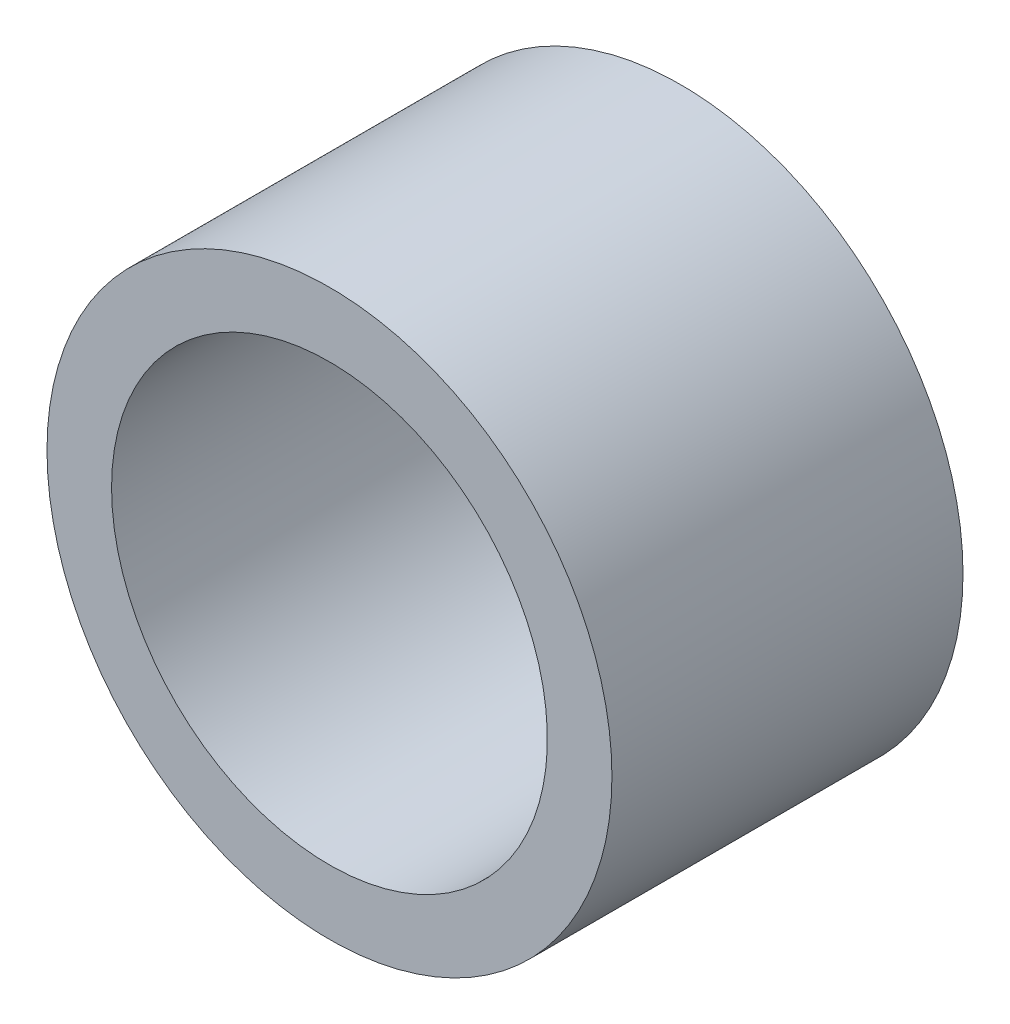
ISO-10303-21;
HEADER;
FILE_DESCRIPTION(('STEP AP214'),'2;1');
FILE_NAME('part.step','',(''),(''),'','','');
FILE_SCHEMA(('AUTOMOTIVE_DESIGN { 1 0 10303 214 1 1 1 1 }'));
ENDSEC;
DATA;
#1=APPLICATION_CONTEXT('core data for automotive mechanical design processes');
#2=APPLICATION_PROTOCOL_DEFINITION('international standard','automotive_design',2000,#1);
#3=PRODUCT_CONTEXT('',#1,'mechanical');
#4=PRODUCT('Part','Part','',(#3));
#5=PRODUCT_RELATED_PRODUCT_CATEGORY('part','',(#4));
#6=PRODUCT_DEFINITION_FORMATION('','',#4);
#7=PRODUCT_DEFINITION_CONTEXT('part definition',#1,'design');
#8=PRODUCT_DEFINITION('design','',#6,#7);
#9=PRODUCT_DEFINITION_SHAPE('','',#8);
#10=(LENGTH_UNIT() NAMED_UNIT(*) SI_UNIT(.MILLI.,.METRE.));
#11=(NAMED_UNIT(*) PLANE_ANGLE_UNIT() SI_UNIT($,.RADIAN.));
#12=(NAMED_UNIT(*) SI_UNIT($,.STERADIAN.) SOLID_ANGLE_UNIT());
#13=UNCERTAINTY_MEASURE_WITH_UNIT(LENGTH_MEASURE(1.E-05),#10,'distance_accuracy_value','');
#14=(GEOMETRIC_REPRESENTATION_CONTEXT(3) GLOBAL_UNCERTAINTY_ASSIGNED_CONTEXT((#13)) GLOBAL_UNIT_ASSIGNED_CONTEXT((#10,
#11,#12)) REPRESENTATION_CONTEXT('',''));
#15=CARTESIAN_POINT('',(0.,0.,0.));
#16=DIRECTION('',(0.,0.,1.));
#17=DIRECTION('',(1.,0.,0.));
#18=AXIS2_PLACEMENT_3D('',#15,#16,#17);
#19=CARTESIAN_POINT('',(2.22044604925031E-13,-1.04246038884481E-13,21.7499999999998));
#20=DIRECTION('',(0.,0.,0.999999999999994));
#21=DIRECTION('',(1.,0.,0.));
#22=AXIS2_PLACEMENT_3D('',#19,#20,#21);
#23=PLANE('',#22);
#24=CARTESIAN_POINT('',(2.22044604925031E-13,-1.04246038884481E-13,21.7499999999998));
#25=DIRECTION('',(0.,0.,0.999999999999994));
#26=DIRECTION('',(1.,0.,0.));
#27=AXIS2_PLACEMENT_3D('',#24,#25,#26);
#28=CIRCLE('',#27,17.5);
#29=CARTESIAN_POINT('',(-17.4999999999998,-1.00654703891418E-13,21.7499999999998));
#30=VERTEX_POINT('',#29);
#31=EDGE_CURVE('E10',#30,#30,#28,.T.);
#32=ORIENTED_EDGE('',*,*,#31,.T.);
#33=EDGE_LOOP('',(#32));
#34=FACE_BOUND('',#33,.T.);
#35=CARTESIAN_POINT('',(2.22044604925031E-13,-1.04246038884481E-13,21.7499999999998));
#36=DIRECTION('',(0.,0.,0.999999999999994));
#37=DIRECTION('',(1.,0.,0.));
#38=AXIS2_PLACEMENT_3D('',#35,#36,#37);
#39=CIRCLE('',#38,13.5);
#40=CARTESIAN_POINT('',(-13.4999999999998,-1.01475580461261E-13,21.7499999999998));
#41=VERTEX_POINT('',#40);
#42=EDGE_CURVE('E41',#41,#41,#39,.T.);
#43=ORIENTED_EDGE('',*,*,#42,.F.);
#44=EDGE_LOOP('',(#43));
#45=FACE_BOUND('',#44,.T.);
#46=ADVANCED_FACE('F30',(#34,#45),#23,.T.);
#47=CARTESIAN_POINT('',(2.22044604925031E-13,1.28315327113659E-13,-3.33066907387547E-13));
#48=DIRECTION('',(0.,0.,0.999999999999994));
#49=DIRECTION('',(1.,0.,0.));
#50=AXIS2_PLACEMENT_3D('',#47,#48,#49);
#51=PLANE('',#50);
#52=CARTESIAN_POINT('',(2.22044604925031E-13,1.28315327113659E-13,-3.33066907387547E-13));
#53=DIRECTION('',(0.,0.,0.999999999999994));
#54=DIRECTION('',(1.,0.,0.));
#55=AXIS2_PLACEMENT_3D('',#52,#53,#54);
#56=CIRCLE('',#55,17.5);
#57=CARTESIAN_POINT('',(-17.4999999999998,-1.02102970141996E-13,-3.2612801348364E-13));
#58=VERTEX_POINT('',#57);
#59=EDGE_CURVE('E37',#58,#58,#56,.T.);
#60=ORIENTED_EDGE('',*,*,#59,.F.);
#61=EDGE_LOOP('',(#60));
#62=FACE_BOUND('',#61,.T.);
#63=CARTESIAN_POINT('',(2.22044604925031E-13,1.28315327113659E-13,-3.33066907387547E-13));
#64=DIRECTION('',(0.,0.,0.999999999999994));
#65=DIRECTION('',(1.,0.,0.));
#66=AXIS2_PLACEMENT_3D('',#63,#64,#65);
#67=CIRCLE('',#66,13.5);
#68=CARTESIAN_POINT('',(-13.4999999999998,-1.02923846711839E-13,-3.2612801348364E-13));
#69=VERTEX_POINT('',#68);
#70=EDGE_CURVE('E46',#69,#69,#67,.T.);
#71=ORIENTED_EDGE('',*,*,#70,.T.);
#72=EDGE_LOOP('',(#71));
#73=FACE_BOUND('',#72,.T.);
#74=ADVANCED_FACE('F52',(#62,#73),#51,.F.);
#75=CARTESIAN_POINT('',(2.22044604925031E-13,-1.04246038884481E-13,21.7499999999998));
#76=DIRECTION('',(0.,0.,-0.999999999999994));
#77=DIRECTION('',(-1.,0.,0.));
#78=AXIS2_PLACEMENT_3D('',#75,#76,#77);
#79=CYLINDRICAL_SURFACE('',#78,17.5);
#80=CARTESIAN_POINT('',(-17.4999999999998,-1.00654703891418E-13,21.7499999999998));
#81=CARTESIAN_POINT('',(-17.4999999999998,-1.00669789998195E-13,21.5234374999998));
#82=CARTESIAN_POINT('',(-17.4999999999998,-1.00684876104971E-13,21.2968749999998));
#83=CARTESIAN_POINT('',(-17.4999999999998,-1.00715048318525E-13,20.8437499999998));
#84=CARTESIAN_POINT('',(-17.4999999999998,-1.00730134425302E-13,20.6171874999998));
#85=CARTESIAN_POINT('',(-17.4999999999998,-1.00760306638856E-13,20.1640624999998));
#86=CARTESIAN_POINT('',(-17.4999999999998,-1.00775392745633E-13,19.9374999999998));
#87=CARTESIAN_POINT('',(-17.4999999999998,-1.00805564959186E-13,19.4843749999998));
#88=CARTESIAN_POINT('',(-17.4999999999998,-1.00820651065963E-13,19.2578124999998));
#89=CARTESIAN_POINT('',(-17.4999999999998,-1.00850823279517E-13,18.8046874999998));
#90=CARTESIAN_POINT('',(-17.4999999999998,-1.00865909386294E-13,18.5781249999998));
#91=CARTESIAN_POINT('',(-17.4999999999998,-1.00896081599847E-13,18.1249999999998));
#92=CARTESIAN_POINT('',(-17.4999999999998,-1.00911167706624E-13,17.8984374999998));
#93=CARTESIAN_POINT('',(-17.4999999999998,-1.00941339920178E-13,17.4453124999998));
#94=CARTESIAN_POINT('',(-17.4999999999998,-1.00956426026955E-13,17.2187499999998));
#95=CARTESIAN_POINT('',(-17.4999999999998,-1.00986598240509E-13,16.7656249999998));
#96=CARTESIAN_POINT('',(-17.4999999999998,-1.01001684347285E-13,16.5390624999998));
#97=CARTESIAN_POINT('',(-17.4999999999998,-1.01031856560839E-13,16.0859374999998));
#98=CARTESIAN_POINT('',(-17.4999999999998,-1.01046942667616E-13,15.8593749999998));
#99=CARTESIAN_POINT('',(-17.4999999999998,-1.0107711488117E-13,15.4062499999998));
#100=CARTESIAN_POINT('',(-17.4999999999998,-1.01092200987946E-13,15.1796874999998));
#101=CARTESIAN_POINT('',(-17.4999999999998,-1.011223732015E-13,14.7265624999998));
#102=CARTESIAN_POINT('',(-17.4999999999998,-1.01137459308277E-13,14.4999999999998));
#103=CARTESIAN_POINT('',(-17.4999999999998,-1.01167631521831E-13,14.0468749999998));
#104=CARTESIAN_POINT('',(-17.4999999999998,-1.01182717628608E-13,13.8203124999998));
#105=CARTESIAN_POINT('',(-17.4999999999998,-1.01212889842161E-13,13.3671874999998));
#106=CARTESIAN_POINT('',(-17.4999999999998,-1.01227975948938E-13,13.1406249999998));
#107=CARTESIAN_POINT('',(-17.4999999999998,-1.01258148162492E-13,12.6874999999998));
#108=CARTESIAN_POINT('',(-17.4999999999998,-1.01273234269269E-13,12.4609374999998));
#109=CARTESIAN_POINT('',(-17.4999999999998,-1.01303406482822E-13,12.0078124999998));
#110=CARTESIAN_POINT('',(-17.4999999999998,-1.01318492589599E-13,11.7812499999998));
#111=CARTESIAN_POINT('',(-17.4999999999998,-1.01348664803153E-13,11.3281249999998));
#112=CARTESIAN_POINT('',(-17.4999999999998,-1.0136375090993E-13,11.1015624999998));
#113=CARTESIAN_POINT('',(-17.4999999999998,-1.01393923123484E-13,10.6484374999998));
#114=CARTESIAN_POINT('',(-17.4999999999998,-1.0140900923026E-13,10.4218749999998));
#115=CARTESIAN_POINT('',(-17.4999999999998,-1.01439181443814E-13,9.96874999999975));
#116=CARTESIAN_POINT('',(-17.4999999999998,-1.01454267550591E-13,9.74218749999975));
#117=CARTESIAN_POINT('',(-17.4999999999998,-1.01484439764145E-13,9.28906249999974));
#118=CARTESIAN_POINT('',(-17.4999999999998,-1.01499525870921E-13,9.06249999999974));
#119=CARTESIAN_POINT('',(-17.4999999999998,-1.01529698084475E-13,8.60937499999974));
#120=CARTESIAN_POINT('',(-17.4999999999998,-1.01544784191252E-13,8.38281249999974));
#121=CARTESIAN_POINT('',(-17.4999999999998,-1.01574956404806E-13,7.92968749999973));
#122=CARTESIAN_POINT('',(-17.4999999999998,-1.01590042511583E-13,7.70312499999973));
#123=CARTESIAN_POINT('',(-17.4999999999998,-1.01620214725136E-13,7.24999999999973));
#124=CARTESIAN_POINT('',(-17.4999999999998,-1.01635300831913E-13,7.02343749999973));
#125=CARTESIAN_POINT('',(-17.4999999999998,-1.01665473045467E-13,6.57031249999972));
#126=CARTESIAN_POINT('',(-17.4999999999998,-1.01680559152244E-13,6.34374999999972));
#127=CARTESIAN_POINT('',(-17.4999999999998,-1.01710731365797E-13,5.89062499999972));
#128=CARTESIAN_POINT('',(-17.4999999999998,-1.01725817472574E-13,5.66406249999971));
#129=CARTESIAN_POINT('',(-17.4999999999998,-1.01755989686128E-13,5.21093749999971));
#130=CARTESIAN_POINT('',(-17.4999999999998,-1.01771075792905E-13,4.98437499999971));
#131=CARTESIAN_POINT('',(-17.4999999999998,-1.01801248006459E-13,4.53124999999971));
#132=CARTESIAN_POINT('',(-17.4999999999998,-1.01816334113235E-13,4.30468749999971));
#133=CARTESIAN_POINT('',(-17.4999999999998,-1.01846506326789E-13,3.8515624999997));
#134=CARTESIAN_POINT('',(-17.4999999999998,-1.01861592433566E-13,3.6249999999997));
#135=CARTESIAN_POINT('',(-17.4999999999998,-1.0189176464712E-13,3.1718749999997));
#136=CARTESIAN_POINT('',(-17.4999999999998,-1.01906850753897E-13,2.9453124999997));
#137=CARTESIAN_POINT('',(-17.4999999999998,-1.0193702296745E-13,2.49218749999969));
#138=CARTESIAN_POINT('',(-17.4999999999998,-1.01952109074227E-13,2.26562499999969));
#139=CARTESIAN_POINT('',(-17.4999999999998,-1.01982281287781E-13,1.81249999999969));
#140=CARTESIAN_POINT('',(-17.4999999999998,-1.01997367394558E-13,1.58593749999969));
#141=CARTESIAN_POINT('',(-17.4999999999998,-1.02027539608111E-13,1.13281249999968));
#142=CARTESIAN_POINT('',(-17.4999999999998,-1.02042625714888E-13,0.90624999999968));
#143=CARTESIAN_POINT('',(-17.4999999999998,-1.02072797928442E-13,0.453124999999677));
#144=CARTESIAN_POINT('',(-17.4999999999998,-1.02087884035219E-13,0.226562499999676));
#145=CARTESIAN_POINT('',(-17.4999999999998,-1.02102970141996E-13,-3.2612801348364E-13));
#146=B_SPLINE_CURVE_WITH_KNOTS('',3,(#80,#81,#82,#83,#84,#85,#86,#87,#88,#89,#90,#91,#92,#93,
#94,#95,#96,#97,#98,#99,#100,#101,#102,#103,#104,#105,#106,#107,#108,#109,#110,#111,#112,#113,
#114,#115,#116,#117,#118,#119,#120,#121,#122,#123,#124,#125,#126,#127,#128,#129,#130,#131,#132,
#133,#134,#135,#136,#137,#138,#139,#140,#141,#142,#143,#144,#145),.UNSPECIFIED.,.F.,.F.,(4,2,2,
2,2,2,2,2,2,2,2,2,2,2,2,2,2,2,2,2,2,2,2,2,2,2,2,2,2,2,2,2,4),(0.,0.679687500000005,
1.35937500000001,2.03906250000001,2.71875000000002,3.39843750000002,4.07812500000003,
4.75781250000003,5.43750000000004,6.11718750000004,6.79687500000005,7.47656250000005,
8.15625000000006,8.83593750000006,9.51562500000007,10.1953125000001,10.8750000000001,
11.5546875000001,12.2343750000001,12.9140625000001,13.5937500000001,14.2734375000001,
14.9531250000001,15.6328125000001,16.3125000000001,16.9921875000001,17.6718750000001,
18.3515625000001,19.0312500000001,19.7109375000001,20.3906250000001,21.0703125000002,
21.7500000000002),.UNSPECIFIED.);
#147=EDGE_CURVE('BSEAM32',#30,#58,#146,.T.);
#148=ORIENTED_EDGE('',*,*,#31,.F.);
#149=ORIENTED_EDGE('',*,*,#59,.T.);
#150=ORIENTED_EDGE('',*,*,#147,.T.);
#151=ORIENTED_EDGE('',*,*,#147,.F.);
#152=EDGE_LOOP('',(#148,#150,#149,#151));
#153=FACE_BOUND('',#152,.T.);
#154=ADVANCED_FACE('F32',(#153),#79,.T.);
#155=CARTESIAN_POINT('',(2.22044604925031E-13,-1.04246038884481E-13,21.7499999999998));
#156=DIRECTION('',(0.,0.,-0.999999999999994));
#157=DIRECTION('',(-1.,0.,0.));
#158=AXIS2_PLACEMENT_3D('',#155,#156,#157);
#159=CYLINDRICAL_SURFACE('',#158,13.5);
#160=CARTESIAN_POINT('',(-13.4999999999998,-1.01475580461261E-13,21.7499999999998));
#161=CARTESIAN_POINT('',(-13.4999999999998,-1.01490666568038E-13,21.5234374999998));
#162=CARTESIAN_POINT('',(-13.4999999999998,-1.01505752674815E-13,21.2968749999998));
#163=CARTESIAN_POINT('',(-13.4999999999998,-1.01535924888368E-13,20.8437499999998));
#164=CARTESIAN_POINT('',(-13.4999999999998,-1.01551010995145E-13,20.6171874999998));
#165=CARTESIAN_POINT('',(-13.4999999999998,-1.01581183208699E-13,20.1640624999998));
#166=CARTESIAN_POINT('',(-13.4999999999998,-1.01596269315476E-13,19.9374999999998));
#167=CARTESIAN_POINT('',(-13.4999999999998,-1.01626441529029E-13,19.4843749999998));
#168=CARTESIAN_POINT('',(-13.4999999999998,-1.01641527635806E-13,19.2578124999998));
#169=CARTESIAN_POINT('',(-13.4999999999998,-1.0167169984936E-13,18.8046874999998));
#170=CARTESIAN_POINT('',(-13.4999999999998,-1.01686785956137E-13,18.5781249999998));
#171=CARTESIAN_POINT('',(-13.4999999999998,-1.0171695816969E-13,18.1249999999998));
#172=CARTESIAN_POINT('',(-13.4999999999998,-1.01732044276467E-13,17.8984374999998));
#173=CARTESIAN_POINT('',(-13.4999999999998,-1.01762216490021E-13,17.4453124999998));
#174=CARTESIAN_POINT('',(-13.4999999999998,-1.01777302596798E-13,17.2187499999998));
#175=CARTESIAN_POINT('',(-13.4999999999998,-1.01807474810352E-13,16.7656249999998));
#176=CARTESIAN_POINT('',(-13.4999999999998,-1.01822560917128E-13,16.5390624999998));
#177=CARTESIAN_POINT('',(-13.4999999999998,-1.01852733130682E-13,16.0859374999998));
#178=CARTESIAN_POINT('',(-13.4999999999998,-1.01867819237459E-13,15.8593749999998));
#179=CARTESIAN_POINT('',(-13.4999999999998,-1.01897991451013E-13,15.4062499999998));
#180=CARTESIAN_POINT('',(-13.4999999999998,-1.0191307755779E-13,15.1796874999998));
#181=CARTESIAN_POINT('',(-13.4999999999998,-1.01943249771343E-13,14.7265624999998));
#182=CARTESIAN_POINT('',(-13.4999999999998,-1.0195833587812E-13,14.4999999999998));
#183=CARTESIAN_POINT('',(-13.4999999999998,-1.01988508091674E-13,14.0468749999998));
#184=CARTESIAN_POINT('',(-13.4999999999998,-1.02003594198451E-13,13.8203124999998));
#185=CARTESIAN_POINT('',(-13.4999999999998,-1.02033766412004E-13,13.3671874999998));
#186=CARTESIAN_POINT('',(-13.4999999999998,-1.02048852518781E-13,13.1406249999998));
#187=CARTESIAN_POINT('',(-13.4999999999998,-1.02079024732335E-13,12.6874999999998));
#188=CARTESIAN_POINT('',(-13.4999999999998,-1.02094110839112E-13,12.4609374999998));
#189=CARTESIAN_POINT('',(-13.4999999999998,-1.02124283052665E-13,12.0078124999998));
#190=CARTESIAN_POINT('',(-13.4999999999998,-1.02139369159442E-13,11.7812499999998));
#191=CARTESIAN_POINT('',(-13.4999999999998,-1.02169541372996E-13,11.3281249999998));
#192=CARTESIAN_POINT('',(-13.4999999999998,-1.02184627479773E-13,11.1015624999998));
#193=CARTESIAN_POINT('',(-13.4999999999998,-1.02214799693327E-13,10.6484374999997));
#194=CARTESIAN_POINT('',(-13.4999999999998,-1.02229885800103E-13,10.4218749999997));
#195=CARTESIAN_POINT('',(-13.4999999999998,-1.02260058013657E-13,9.96874999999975));
#196=CARTESIAN_POINT('',(-13.4999999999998,-1.02275144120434E-13,9.74218749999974));
#197=CARTESIAN_POINT('',(-13.4999999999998,-1.02305316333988E-13,9.28906249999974));
#198=CARTESIAN_POINT('',(-13.4999999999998,-1.02320402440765E-13,9.06249999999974));
#199=CARTESIAN_POINT('',(-13.4999999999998,-1.02350574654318E-13,8.60937499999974));
#200=CARTESIAN_POINT('',(-13.4999999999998,-1.02365660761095E-13,8.38281249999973));
#201=CARTESIAN_POINT('',(-13.4999999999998,-1.02395832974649E-13,7.92968749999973));
#202=CARTESIAN_POINT('',(-13.4999999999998,-1.02410919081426E-13,7.70312499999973));
#203=CARTESIAN_POINT('',(-13.4999999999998,-1.02441091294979E-13,7.24999999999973));
#204=CARTESIAN_POINT('',(-13.4999999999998,-1.02456177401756E-13,7.02343749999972));
#205=CARTESIAN_POINT('',(-13.4999999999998,-1.0248634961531E-13,6.57031249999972));
#206=CARTESIAN_POINT('',(-13.4999999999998,-1.02501435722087E-13,6.34374999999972));
#207=CARTESIAN_POINT('',(-13.4999999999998,-1.02531607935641E-13,5.89062499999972));
#208=CARTESIAN_POINT('',(-13.4999999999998,-1.02546694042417E-13,5.66406249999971));
#209=CARTESIAN_POINT('',(-13.4999999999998,-1.02576866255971E-13,5.21093749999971));
#210=CARTESIAN_POINT('',(-13.4999999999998,-1.02591952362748E-13,4.98437499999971));
#211=CARTESIAN_POINT('',(-13.4999999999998,-1.02622124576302E-13,4.53124999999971));
#212=CARTESIAN_POINT('',(-13.4999999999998,-1.02637210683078E-13,4.30468749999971));
#213=CARTESIAN_POINT('',(-13.4999999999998,-1.02667382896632E-13,3.8515624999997));
#214=CARTESIAN_POINT('',(-13.4999999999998,-1.02682469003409E-13,3.6249999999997));
#215=CARTESIAN_POINT('',(-13.4999999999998,-1.02712641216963E-13,3.1718749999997));
#216=CARTESIAN_POINT('',(-13.4999999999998,-1.0272772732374E-13,2.9453124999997));
#217=CARTESIAN_POINT('',(-13.4999999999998,-1.02757899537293E-13,2.49218749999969));
#218=CARTESIAN_POINT('',(-13.4999999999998,-1.0277298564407E-13,2.26562499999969));
#219=CARTESIAN_POINT('',(-13.4999999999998,-1.02803157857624E-13,1.81249999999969));
#220=CARTESIAN_POINT('',(-13.4999999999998,-1.02818243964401E-13,1.58593749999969));
#221=CARTESIAN_POINT('',(-13.4999999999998,-1.02848416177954E-13,1.13281249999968));
#222=CARTESIAN_POINT('',(-13.4999999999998,-1.02863502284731E-13,0.90624999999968));
#223=CARTESIAN_POINT('',(-13.4999999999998,-1.02893674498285E-13,0.453124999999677));
#224=CARTESIAN_POINT('',(-13.4999999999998,-1.02908760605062E-13,0.226562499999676));
#225=CARTESIAN_POINT('',(-13.4999999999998,-1.02923846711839E-13,-3.2612801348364E-13));
#226=B_SPLINE_CURVE_WITH_KNOTS('',3,(#160,#161,#162,#163,#164,#165,#166,#167,#168,#169,#170,
#171,#172,#173,#174,#175,#176,#177,#178,#179,#180,#181,#182,#183,#184,#185,#186,#187,#188,#189,
#190,#191,#192,#193,#194,#195,#196,#197,#198,#199,#200,#201,#202,#203,#204,#205,#206,#207,#208,
#209,#210,#211,#212,#213,#214,#215,#216,#217,#218,#219,#220,#221,#222,#223,#224,#225),
.UNSPECIFIED.,.F.,.F.,(4,2,2,2,2,2,2,2,2,2,2,2,2,2,2,2,2,2,2,2,2,2,2,2,2,2,2,2,2,2,2,2,4),(0.,
0.679687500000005,1.35937500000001,2.03906250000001,2.71875000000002,3.39843750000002,
4.07812500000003,4.75781250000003,5.43750000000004,6.11718750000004,6.79687500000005,
7.47656250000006,8.15625000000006,8.83593750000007,9.51562500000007,10.1953125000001,
10.8750000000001,11.5546875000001,12.2343750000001,12.9140625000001,13.5937500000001,
14.2734375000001,14.9531250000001,15.6328125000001,16.3125000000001,16.9921875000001,
17.6718750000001,18.3515625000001,19.0312500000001,19.7109375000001,20.3906250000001,
21.0703125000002,21.7500000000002),.UNSPECIFIED.);
#227=EDGE_CURVE('BSEAM54',#41,#69,#226,.T.);
#228=ORIENTED_EDGE('',*,*,#42,.T.);
#229=ORIENTED_EDGE('',*,*,#70,.F.);
#230=ORIENTED_EDGE('',*,*,#227,.T.);
#231=ORIENTED_EDGE('',*,*,#227,.F.);
#232=EDGE_LOOP('',(#228,#230,#229,#231));
#233=FACE_BOUND('',#232,.T.);
#234=ADVANCED_FACE('F54',(#233),#159,.F.);
#235=CLOSED_SHELL('',(#46,#74,#154,#234));
#236=MANIFOLD_SOLID_BREP('B2',#235);
#237=ADVANCED_BREP_SHAPE_REPRESENTATION('',(#18,#236),#14);
#238=SHAPE_DEFINITION_REPRESENTATION(#9,#237);
ENDSEC;
END-ISO-10303-21;
